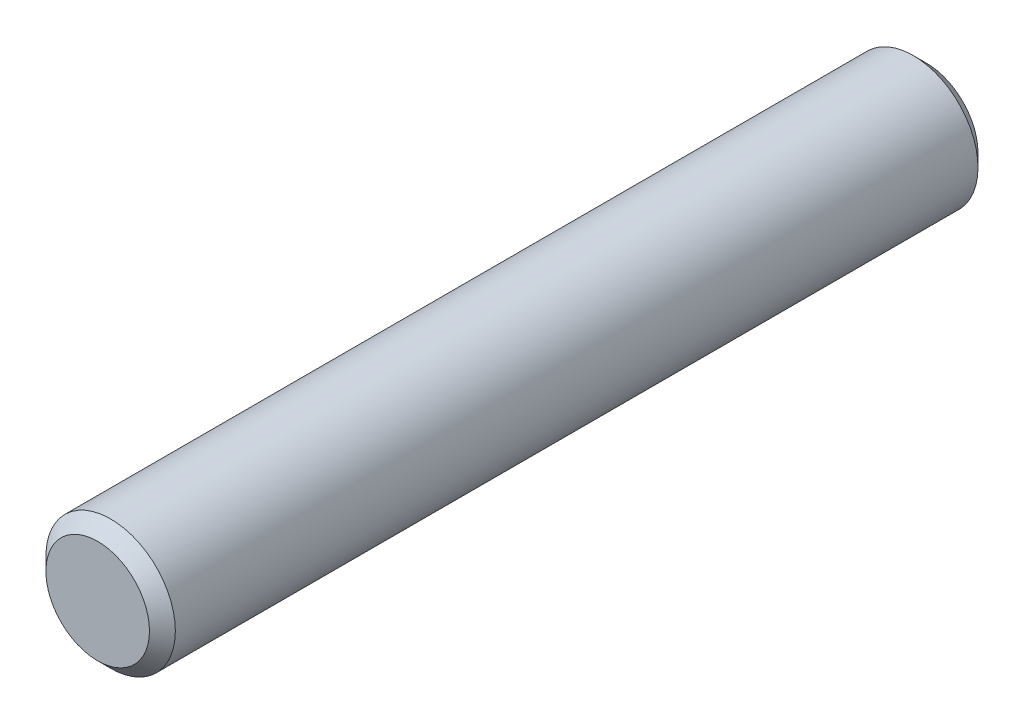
ISO-10303-21;
HEADER;
FILE_DESCRIPTION(('STEP AP214'),'2;1');
FILE_NAME('part.step','',(''),(''),'','','');
FILE_SCHEMA(('AUTOMOTIVE_DESIGN { 1 0 10303 214 1 1 1 1 }'));
ENDSEC;
DATA;
#1=APPLICATION_CONTEXT('core data for automotive mechanical design processes');
#2=APPLICATION_PROTOCOL_DEFINITION('international standard','automotive_design',2000,#1);
#3=PRODUCT_CONTEXT('',#1,'mechanical');
#4=PRODUCT('Part','Part','',(#3));
#5=PRODUCT_RELATED_PRODUCT_CATEGORY('part','',(#4));
#6=PRODUCT_DEFINITION_FORMATION('','',#4);
#7=PRODUCT_DEFINITION_CONTEXT('part definition',#1,'design');
#8=PRODUCT_DEFINITION('design','',#6,#7);
#9=PRODUCT_DEFINITION_SHAPE('','',#8);
#10=(LENGTH_UNIT() NAMED_UNIT(*) SI_UNIT(.MILLI.,.METRE.));
#11=(NAMED_UNIT(*) PLANE_ANGLE_UNIT() SI_UNIT($,.RADIAN.));
#12=(NAMED_UNIT(*) SI_UNIT($,.STERADIAN.) SOLID_ANGLE_UNIT());
#13=UNCERTAINTY_MEASURE_WITH_UNIT(LENGTH_MEASURE(1.E-05),#10,'distance_accuracy_value','');
#14=(GEOMETRIC_REPRESENTATION_CONTEXT(3) GLOBAL_UNCERTAINTY_ASSIGNED_CONTEXT((#13)) GLOBAL_UNIT_ASSIGNED_CONTEXT((#10,
#11,#12)) REPRESENTATION_CONTEXT('',''));
#15=CARTESIAN_POINT('',(0.,0.,0.));
#16=DIRECTION('',(0.,0.,1.));
#17=DIRECTION('',(1.,0.,0.));
#18=AXIS2_PLACEMENT_3D('',#15,#16,#17);
#19=CARTESIAN_POINT('',(0.,0.,6.4));
#20=DIRECTION('',(0.,0.,-1.));
#21=DIRECTION('',(-1.,0.,0.));
#22=AXIS2_PLACEMENT_3D('',#19,#20,#21);
#23=CYLINDRICAL_SURFACE('',#22,0.5);
#24=CARTESIAN_POINT('',(0.,0.,6.3));
#25=DIRECTION('',(0.,0.,1.));
#26=DIRECTION('',(1.,0.,0.));
#27=AXIS2_PLACEMENT_3D('',#24,#25,#26);
#28=CIRCLE('',#27,0.5);
#29=CARTESIAN_POINT('',(0.5,0.,6.3));
#30=VERTEX_POINT('',#29);
#31=EDGE_CURVE('E352',#30,#30,#28,.F.);
#32=ORIENTED_EDGE('',*,*,#31,.T.);
#33=EDGE_LOOP('',(#32));
#34=FACE_BOUND('',#33,.T.);
#35=CARTESIAN_POINT('',(0.,0.,0.1));
#36=DIRECTION('',(0.,0.,1.));
#37=DIRECTION('',(1.,0.,0.));
#38=AXIS2_PLACEMENT_3D('',#35,#36,#37);
#39=CIRCLE('',#38,0.5);
#40=CARTESIAN_POINT('',(0.5,0.,0.1));
#41=VERTEX_POINT('',#40);
#42=EDGE_CURVE('E356',#41,#41,#39,.T.);
#43=ORIENTED_EDGE('',*,*,#42,.T.);
#44=EDGE_LOOP('',(#43));
#45=FACE_BOUND('',#44,.T.);
#46=ADVANCED_FACE('F346',(#34,#45),#23,.T.);
#47=CARTESIAN_POINT('',(0.,0.,6.4));
#48=DIRECTION('',(0.,0.,1.));
#49=DIRECTION('',(1.,0.,0.));
#50=AXIS2_PLACEMENT_3D('',#47,#48,#49);
#51=PLANE('',#50);
#52=CARTESIAN_POINT('',(0.,0.,6.4));
#53=DIRECTION('',(0.,0.,1.));
#54=DIRECTION('',(1.,0.,0.));
#55=AXIS2_PLACEMENT_3D('',#52,#53,#54);
#56=CIRCLE('',#55,0.4);
#57=CARTESIAN_POINT('',(0.4,0.,6.4));
#58=VERTEX_POINT('',#57);
#59=EDGE_CURVE('E360',#58,#58,#56,.T.);
#60=ORIENTED_EDGE('',*,*,#59,.T.);
#61=EDGE_LOOP('',(#60));
#62=FACE_BOUND('',#61,.T.);
#63=ADVANCED_FACE('F366',(#62),#51,.T.);
#64=CARTESIAN_POINT('',(0.,0.,0.));
#65=DIRECTION('',(0.,0.,1.));
#66=DIRECTION('',(1.,0.,0.));
#67=AXIS2_PLACEMENT_3D('',#64,#65,#66);
#68=PLANE('',#67);
#69=CARTESIAN_POINT('',(0.,0.,0.));
#70=DIRECTION('',(0.,0.,1.));
#71=DIRECTION('',(1.,0.,0.));
#72=AXIS2_PLACEMENT_3D('',#69,#70,#71);
#73=CIRCLE('',#72,0.4);
#74=CARTESIAN_POINT('',(0.4,0.,0.));
#75=VERTEX_POINT('',#74);
#76=EDGE_CURVE('E10',#75,#75,#73,.F.);
#77=ORIENTED_EDGE('',*,*,#76,.T.);
#78=EDGE_LOOP('',(#77));
#79=FACE_BOUND('',#78,.T.);
#80=ADVANCED_FACE('F371',(#79),#68,.F.);
#81=CARTESIAN_POINT('',(0.,0.,6.4));
#82=DIRECTION('',(0.,0.,-1.));
#83=DIRECTION('',(-1.,0.,0.));
#84=AXIS2_PLACEMENT_3D('',#81,#82,#83);
#85=CONICAL_SURFACE('',#84,0.4,0.785398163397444);
#86=ORIENTED_EDGE('',*,*,#31,.F.);
#87=EDGE_LOOP('',(#86));
#88=FACE_BOUND('',#87,.T.);
#89=ORIENTED_EDGE('',*,*,#59,.F.);
#90=EDGE_LOOP('',(#89));
#91=FACE_BOUND('',#90,.T.);
#92=ADVANCED_FACE('F368',(#88,#91),#85,.T.);
#93=CARTESIAN_POINT('',(0.,0.,0.1));
#94=DIRECTION('',(0.,0.,1.));
#95=DIRECTION('',(1.,0.,0.));
#96=AXIS2_PLACEMENT_3D('',#93,#94,#95);
#97=CONICAL_SURFACE('',#96,0.5,0.785398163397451);
#98=ORIENTED_EDGE('',*,*,#76,.F.);
#99=EDGE_LOOP('',(#98));
#100=FACE_BOUND('',#99,.T.);
#101=ORIENTED_EDGE('',*,*,#42,.F.);
#102=EDGE_LOOP('',(#101));
#103=FACE_BOUND('',#102,.T.);
#104=ADVANCED_FACE('F370',(#100,#103),#97,.T.);
#105=CLOSED_SHELL('',(#46,#63,#80,#92,#104));
#106=MANIFOLD_SOLID_BREP('B2',#105);
#107=ADVANCED_BREP_SHAPE_REPRESENTATION('',(#18,#106),#14);
#108=SHAPE_DEFINITION_REPRESENTATION(#9,#107);
ENDSEC;
END-ISO-10303-21;
